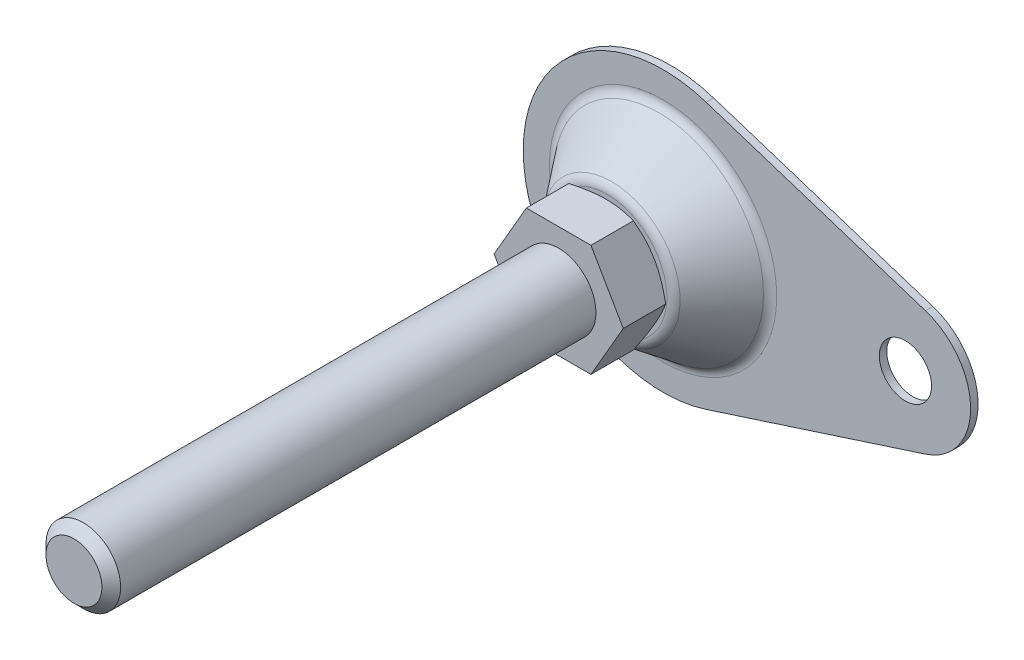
ISO-10303-21;
HEADER;
FILE_DESCRIPTION(('STEP AP214'),'2;1');
FILE_NAME('part.step','',(''),(''),'','','');
FILE_SCHEMA(('AUTOMOTIVE_DESIGN { 1 0 10303 214 1 1 1 1 }'));
ENDSEC;
DATA;
#1=APPLICATION_CONTEXT('core data for automotive mechanical design processes');
#2=APPLICATION_PROTOCOL_DEFINITION('international standard','automotive_design',2000,#1);
#3=PRODUCT_CONTEXT('',#1,'mechanical');
#4=PRODUCT('Part','Part','',(#3));
#5=PRODUCT_RELATED_PRODUCT_CATEGORY('part','',(#4));
#6=PRODUCT_DEFINITION_FORMATION('','',#4);
#7=PRODUCT_DEFINITION_CONTEXT('part definition',#1,'design');
#8=PRODUCT_DEFINITION('design','',#6,#7);
#9=PRODUCT_DEFINITION_SHAPE('','',#8);
#10=(LENGTH_UNIT() NAMED_UNIT(*) SI_UNIT(.MILLI.,.METRE.));
#11=(NAMED_UNIT(*) PLANE_ANGLE_UNIT() SI_UNIT($,.RADIAN.));
#12=(NAMED_UNIT(*) SI_UNIT($,.STERADIAN.) SOLID_ANGLE_UNIT());
#13=UNCERTAINTY_MEASURE_WITH_UNIT(LENGTH_MEASURE(1.E-05),#10,'distance_accuracy_value','');
#14=(GEOMETRIC_REPRESENTATION_CONTEXT(3) GLOBAL_UNCERTAINTY_ASSIGNED_CONTEXT((#13)) GLOBAL_UNIT_ASSIGNED_CONTEXT((#10,
#11,#12)) REPRESENTATION_CONTEXT('',''));
#15=CARTESIAN_POINT('',(0.,0.,0.));
#16=DIRECTION('',(0.,0.,1.));
#17=DIRECTION('',(1.,0.,0.));
#18=AXIS2_PLACEMENT_3D('',#15,#16,#17);
#19=CARTESIAN_POINT('',(65.,0.,2.));
#20=DIRECTION('',(0.,0.,1.));
#21=DIRECTION('',(1.,0.,0.));
#22=AXIS2_PLACEMENT_3D('',#19,#20,#21);
#23=PLANE('',#22);
#24=CARTESIAN_POINT('',(0.,0.,2.));
#25=DIRECTION('',(0.,0.,1.));
#26=DIRECTION('',(1.,0.,0.));
#27=AXIS2_PLACEMENT_3D('',#24,#25,#26);
#28=CIRCLE('',#27,30.4802116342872);
#29=CARTESIAN_POINT('',(30.4802116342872,0.,2.));
#30=VERTEX_POINT('',#29);
#31=EDGE_CURVE('E245',#30,#30,#28,.F.);
#32=ORIENTED_EDGE('',*,*,#31,.T.);
#33=EDGE_LOOP('',(#32));
#34=FACE_BOUND('',#33,.T.);
#35=CARTESIAN_POINT('',(65.,0.,2.));
#36=DIRECTION('',(0.,0.,1.));
#37=DIRECTION('',(1.,0.,0.));
#38=AXIS2_PLACEMENT_3D('',#35,#36,#37);
#39=CIRCLE('',#38,7.);
#40=CARTESIAN_POINT('',(72.,0.,2.));
#41=VERTEX_POINT('',#40);
#42=EDGE_CURVE('E262',#41,#41,#39,.T.);
#43=ORIENTED_EDGE('',*,*,#42,.F.);
#44=EDGE_LOOP('',(#43));
#45=FACE_BOUND('',#44,.T.);
#46=DIRECTION('',(-0.951485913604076,0.307692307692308,0.));
#47=VECTOR('',#46,1.);
#48=CARTESIAN_POINT('',(11.5384615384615,35.6807217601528,2.));
#49=LINE('',#48,#47);
#50=CARTESIAN_POINT('',(70.3846153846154,16.6510034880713,2.));
#51=VERTEX_POINT('',#50);
#52=CARTESIAN_POINT('',(11.5384615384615,35.6807217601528,2.));
#53=VERTEX_POINT('',#52);
#54=EDGE_CURVE('E112',#51,#53,#49,.T.);
#55=ORIENTED_EDGE('',*,*,#54,.T.);
#56=CARTESIAN_POINT('',(0.,0.,2.));
#57=DIRECTION('',(0.,0.,1.));
#58=DIRECTION('',(1.,0.,0.));
#59=AXIS2_PLACEMENT_3D('',#56,#57,#58);
#60=CIRCLE('',#59,37.5);
#61=CARTESIAN_POINT('',(11.5384615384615,-35.6807217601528,2.));
#62=VERTEX_POINT('',#61);
#63=EDGE_CURVE('E114',#53,#62,#60,.T.);
#64=ORIENTED_EDGE('',*,*,#63,.T.);
#65=DIRECTION('',(0.951485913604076,0.307692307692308,0.));
#66=VECTOR('',#65,1.);
#67=CARTESIAN_POINT('',(11.5384615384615,-35.6807217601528,2.));
#68=LINE('',#67,#66);
#69=CARTESIAN_POINT('',(70.3846153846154,-16.6510034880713,2.));
#70=VERTEX_POINT('',#69);
#71=EDGE_CURVE('E97',#62,#70,#68,.T.);
#72=ORIENTED_EDGE('',*,*,#71,.T.);
#73=CARTESIAN_POINT('',(65.,0.,2.));
#74=DIRECTION('',(0.,0.,1.));
#75=DIRECTION('',(1.,0.,0.));
#76=AXIS2_PLACEMENT_3D('',#73,#74,#75);
#77=CIRCLE('',#76,17.5);
#78=EDGE_CURVE('E106',#70,#51,#77,.T.);
#79=ORIENTED_EDGE('',*,*,#78,.T.);
#80=EDGE_LOOP('',(#55,#64,#72,#79));
#81=FACE_BOUND('',#80,.T.);
#82=ADVANCED_FACE('F14',(#34,#45,#81),#23,.T.);
#83=CARTESIAN_POINT('',(65.,0.,0.));
#84=DIRECTION('',(0.,0.,1.));
#85=DIRECTION('',(1.,0.,0.));
#86=AXIS2_PLACEMENT_3D('',#83,#84,#85);
#87=PLANE('',#86);
#88=CARTESIAN_POINT('',(65.,0.,0.));
#89=DIRECTION('',(0.,0.,1.));
#90=DIRECTION('',(1.,0.,0.));
#91=AXIS2_PLACEMENT_3D('',#88,#89,#90);
#92=CIRCLE('',#91,7.);
#93=CARTESIAN_POINT('',(72.,0.,0.));
#94=VERTEX_POINT('',#93);
#95=EDGE_CURVE('E258',#94,#94,#92,.T.);
#96=ORIENTED_EDGE('',*,*,#95,.T.);
#97=EDGE_LOOP('',(#96));
#98=FACE_BOUND('',#97,.T.);
#99=CARTESIAN_POINT('',(0.,0.,0.));
#100=DIRECTION('',(0.,0.,1.));
#101=DIRECTION('',(1.,0.,0.));
#102=AXIS2_PLACEMENT_3D('',#99,#100,#101);
#103=CIRCLE('',#102,37.5);
#104=CARTESIAN_POINT('',(11.5384615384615,35.6807217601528,0.));
#105=VERTEX_POINT('',#104);
#106=CARTESIAN_POINT('',(11.5384615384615,-35.6807217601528,0.));
#107=VERTEX_POINT('',#106);
#108=EDGE_CURVE('E275',#105,#107,#103,.T.);
#109=ORIENTED_EDGE('',*,*,#108,.F.);
#110=DIRECTION('',(-0.951485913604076,0.307692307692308,0.));
#111=VECTOR('',#110,1.);
#112=CARTESIAN_POINT('',(70.3846153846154,16.6510034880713,0.));
#113=LINE('',#112,#111);
#114=CARTESIAN_POINT('',(70.3846153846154,16.6510034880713,0.));
#115=VERTEX_POINT('',#114);
#116=EDGE_CURVE('E9',#115,#105,#113,.T.);
#117=ORIENTED_EDGE('',*,*,#116,.F.);
#118=CARTESIAN_POINT('',(65.,0.,0.));
#119=DIRECTION('',(0.,0.,1.));
#120=DIRECTION('',(1.,0.,0.));
#121=AXIS2_PLACEMENT_3D('',#118,#119,#120);
#122=CIRCLE('',#121,17.5);
#123=CARTESIAN_POINT('',(70.3846153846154,-16.6510034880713,0.));
#124=VERTEX_POINT('',#123);
#125=EDGE_CURVE('E22',#124,#115,#122,.T.);
#126=ORIENTED_EDGE('',*,*,#125,.F.);
#127=DIRECTION('',(0.951485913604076,0.307692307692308,0.));
#128=VECTOR('',#127,1.);
#129=CARTESIAN_POINT('',(70.3846153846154,-16.6510034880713,0.));
#130=LINE('',#129,#128);
#131=EDGE_CURVE('E99',#107,#124,#130,.T.);
#132=ORIENTED_EDGE('',*,*,#131,.F.);
#133=EDGE_LOOP('',(#109,#117,#126,#132));
#134=FACE_BOUND('',#133,.T.);
#135=ADVANCED_FACE('F215',(#98,#134),#87,.F.);
#136=CARTESIAN_POINT('',(0.,0.,17.));
#137=DIRECTION('',(0.,0.,-1.));
#138=DIRECTION('',(-1.,0.,0.));
#139=AXIS2_PLACEMENT_3D('',#136,#137,#138);
#140=PLANE('',#139);
#141=CARTESIAN_POINT('',(0.,0.,17.));
#142=DIRECTION('',(0.,0.,-1.));
#143=DIRECTION('',(-1.,0.,0.));
#144=AXIS2_PLACEMENT_3D('',#141,#142,#143);
#145=CIRCLE('',#144,16.0197883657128);
#146=CARTESIAN_POINT('',(-16.0197883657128,0.,17.));
#147=VERTEX_POINT('',#146);
#148=EDGE_CURVE('E278',#147,#147,#145,.F.);
#149=ORIENTED_EDGE('',*,*,#148,.T.);
#150=EDGE_LOOP('',(#149));
#151=FACE_BOUND('',#150,.T.);
#152=CARTESIAN_POINT('',(0.,0.,17.));
#153=DIRECTION('',(0.,0.,-1.));
#154=DIRECTION('',(-1.,0.,0.));
#155=AXIS2_PLACEMENT_3D('',#152,#153,#154);
#156=CIRCLE('',#155,14.5);
#157=CARTESIAN_POINT('',(-14.5,0.,17.));
#158=VERTEX_POINT('',#157);
#159=EDGE_CURVE('E122',#158,#158,#156,.T.);
#160=ORIENTED_EDGE('',*,*,#159,.T.);
#161=EDGE_LOOP('',(#160));
#162=FACE_BOUND('',#161,.T.);
#163=ADVANCED_FACE('F211',(#151,#162),#140,.F.);
#164=CARTESIAN_POINT('',(0.,0.,5.));
#165=DIRECTION('',(0.,0.,1.));
#166=DIRECTION('',(1.,0.,0.));
#167=AXIS2_PLACEMENT_3D('',#164,#165,#166);
#168=TOROIDAL_SURFACE('',#167,30.4802116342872,3.);
#169=CARTESIAN_POINT('',(0.,0.,3.1747053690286));
#170=DIRECTION('',(0.,0.,1.));
#171=DIRECTION('',(1.,0.,0.));
#172=AXIS2_PLACEMENT_3D('',#169,#170,#171);
#173=CIRCLE('',#172,28.0993925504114);
#174=CARTESIAN_POINT('',(28.0993925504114,0.,3.1747053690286));
#175=VERTEX_POINT('',#174);
#176=EDGE_CURVE('E242',#175,#175,#173,.T.);
#177=ORIENTED_EDGE('',*,*,#176,.F.);
#178=EDGE_LOOP('',(#177));
#179=FACE_BOUND('',#178,.T.);
#180=ORIENTED_EDGE('',*,*,#31,.F.);
#181=EDGE_LOOP('',(#180));
#182=FACE_BOUND('',#181,.T.);
#183=ADVANCED_FACE('F214',(#179,#182),#168,.F.);
#184=CARTESIAN_POINT('',(0.,0.,14.));
#185=DIRECTION('',(0.,0.,-1.));
#186=DIRECTION('',(-1.,0.,0.));
#187=AXIS2_PLACEMENT_3D('',#184,#185,#186);
#188=TOROIDAL_SURFACE('',#187,16.0197883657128,3.);
#189=ORIENTED_EDGE('',*,*,#148,.F.);
#190=EDGE_LOOP('',(#189));
#191=FACE_BOUND('',#190,.T.);
#192=CARTESIAN_POINT('',(0.,0.,15.8252946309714));
#193=DIRECTION('',(0.,0.,1.));
#194=DIRECTION('',(1.,0.,0.));
#195=AXIS2_PLACEMENT_3D('',#192,#193,#194);
#196=CIRCLE('',#195,18.4006074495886);
#197=CARTESIAN_POINT('',(18.4006074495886,0.,15.8252946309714));
#198=VERTEX_POINT('',#197);
#199=EDGE_CURVE('E251',#198,#198,#196,.F.);
#200=ORIENTED_EDGE('',*,*,#199,.F.);
#201=EDGE_LOOP('',(#200));
#202=FACE_BOUND('',#201,.T.);
#203=ADVANCED_FACE('F229',(#191,#202),#188,.T.);
#204=CARTESIAN_POINT('',(0.,0.,2.));
#205=DIRECTION('',(0.,0.,-1.));
#206=DIRECTION('',(-1.,0.,0.));
#207=AXIS2_PLACEMENT_3D('',#204,#205,#206);
#208=CYLINDRICAL_SURFACE('',#207,37.5);
#209=ORIENTED_EDGE('',*,*,#108,.T.);
#210=DIRECTION('',(0.,0.,1.));
#211=VECTOR('',#210,1.);
#212=CARTESIAN_POINT('',(11.5384615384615,-35.6807217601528,-8.));
#213=LINE('',#212,#211);
#214=EDGE_CURVE('E103',#107,#62,#213,.T.);
#215=ORIENTED_EDGE('',*,*,#214,.T.);
#216=ORIENTED_EDGE('',*,*,#63,.F.);
#217=DIRECTION('',(0.,0.,1.));
#218=VECTOR('',#217,1.);
#219=CARTESIAN_POINT('',(11.5384615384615,35.6807217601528,-8.));
#220=LINE('',#219,#218);
#221=EDGE_CURVE('E119',#105,#53,#220,.T.);
#222=ORIENTED_EDGE('',*,*,#221,.F.);
#223=EDGE_LOOP('',(#209,#215,#216,#222));
#224=FACE_BOUND('',#223,.T.);
#225=ADVANCED_FACE('F219',(#224),#208,.T.);
#226=CARTESIAN_POINT('',(65.,0.,2.));
#227=DIRECTION('',(0.,0.,-1.));
#228=DIRECTION('',(-1.,0.,0.));
#229=AXIS2_PLACEMENT_3D('',#226,#227,#228);
#230=CYLINDRICAL_SURFACE('',#229,7.);
#231=ORIENTED_EDGE('',*,*,#42,.T.);
#232=EDGE_LOOP('',(#231));
#233=FACE_BOUND('',#232,.T.);
#234=ORIENTED_EDGE('',*,*,#95,.F.);
#235=EDGE_LOOP('',(#234));
#236=FACE_BOUND('',#235,.T.);
#237=ADVANCED_FACE('F209',(#233,#236),#230,.F.);
#238=CARTESIAN_POINT('',(0.,0.,2.));
#239=DIRECTION('',(0.,0.,-1.));
#240=DIRECTION('',(-1.,0.,0.));
#241=AXIS2_PLACEMENT_3D('',#238,#239,#240);
#242=CONICAL_SURFACE('',#241,29.,0.654082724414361);
#243=ORIENTED_EDGE('',*,*,#176,.T.);
#244=EDGE_LOOP('',(#243));
#245=FACE_BOUND('',#244,.T.);
#246=ORIENTED_EDGE('',*,*,#199,.T.);
#247=EDGE_LOOP('',(#246));
#248=FACE_BOUND('',#247,.T.);
#249=ADVANCED_FACE('F151',(#245,#248),#242,.T.);
#250=CARTESIAN_POINT('',(0.,0.,17.));
#251=DIRECTION('',(0.,0.,1.));
#252=DIRECTION('',(1.,0.,0.));
#253=AXIS2_PLACEMENT_3D('',#250,#251,#252);
#254=CONICAL_SURFACE('',#253,14.5,1.0471975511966);
#255=ORIENTED_EDGE('',*,*,#159,.F.);
#256=EDGE_LOOP('',(#255));
#257=FACE_BOUND('',#256,.T.);
#258=CARTESIAN_POINT('',(17.3206235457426,0.0002,18.6284877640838));
#259=CARTESIAN_POINT('',(17.130274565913,-0.329494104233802,18.5185969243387));
#260=CARTESIAN_POINT('',(16.939183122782,-0.660474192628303,18.4136927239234));
#261=CARTESIAN_POINT('',(16.5554679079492,-1.32508844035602,18.2152437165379));
#262=CARTESIAN_POINT('',(16.3628436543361,-1.6587234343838,18.1217026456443));
#263=CARTESIAN_POINT('',(15.9756905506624,-2.32929228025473,17.9472372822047));
#264=CARTESIAN_POINT('',(15.7811583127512,-2.66623200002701,17.866342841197));
#265=CARTESIAN_POINT('',(15.3907420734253,-3.34245276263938,17.7189077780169));
#266=CARTESIAN_POINT('',(15.1948581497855,-3.68173367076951,17.6523663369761));
#267=CARTESIAN_POINT('',(14.8067578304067,-4.35394314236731,17.5364675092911));
#268=CARTESIAN_POINT('',(14.6145702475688,-4.68682180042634,17.4867265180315));
#269=CARTESIAN_POINT('',(14.2293144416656,-5.35410443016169,17.4033218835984));
#270=CARTESIAN_POINT('',(14.0362462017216,-5.68850843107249,17.3696585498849));
#271=CARTESIAN_POINT('',(13.6497853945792,-6.35787818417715,17.3192592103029));
#272=CARTESIAN_POINT('',(13.4563934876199,-6.69284279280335,17.3025030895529));
#273=CARTESIAN_POINT('',(13.0694311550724,-7.363081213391,17.2862785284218));
#274=CARTESIAN_POINT('',(12.8758607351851,-7.69835501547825,17.2868095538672));
#275=CARTESIAN_POINT('',(12.5139822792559,-8.3251468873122,17.303951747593));
#276=CARTESIAN_POINT('',(12.3456484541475,-8.61670962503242,17.3184719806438));
#277=CARTESIAN_POINT('',(12.0093680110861,-9.19916443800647,17.3603122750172));
#278=CARTESIAN_POINT('',(11.8414214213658,-9.49005646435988,17.3876332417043));
#279=CARTESIAN_POINT('',(11.5060066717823,-10.0710118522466,17.4545986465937));
#280=CARTESIAN_POINT('',(11.338539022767,-10.3610743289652,17.4942532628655));
#281=CARTESIAN_POINT('',(11.0043888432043,-10.939839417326,17.5851902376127));
#282=CARTESIAN_POINT('',(10.8377063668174,-11.2285419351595,17.6364733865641));
#283=CARTESIAN_POINT('',(10.3317324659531,-12.1049144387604,17.8090619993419));
#284=CARTESIAN_POINT('',(9.99390625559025,-12.6900465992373,17.9475763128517));
#285=CARTESIAN_POINT('',(9.32329122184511,-13.8515859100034,18.26194710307));
#286=CARTESIAN_POINT('',(8.99049381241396,-14.4280079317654,18.4377297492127));
#287=CARTESIAN_POINT('',(8.66013856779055,-15.0002,18.6284877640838));
#288=B_SPLINE_CURVE_WITH_KNOTS('',3,(#258,#259,#260,#261,#262,#263,#264,#265,#266,#267,#268,
#269,#270,#271,#272,#273,#274,#275,#276,#277,#278,#279,#280,#281,#282,#283,#284,#285,#286,#287),
.UNSPECIFIED.,.F.,.F.,(4,2,2,2,2,2,2,2,2,2,2,2,2,2,4),(0.,1.18875411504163,2.37789802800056,
3.56980778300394,4.76164951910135,5.92407379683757,7.0865204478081,8.24758247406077,
9.40860862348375,10.4193068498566,11.4300765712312,12.4416826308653,13.4533574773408,
15.5211962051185,17.5849760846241),.UNSPECIFIED.);
#289=CARTESIAN_POINT('',(17.3205080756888,0.,18.6284210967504));
#290=VERTEX_POINT('',#289);
#291=CARTESIAN_POINT('',(8.66025403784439,-15.,18.6284210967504));
#292=VERTEX_POINT('',#291);
#293=EDGE_CURVE('E29',#290,#292,#288,.T.);
#294=ORIENTED_EDGE('',*,*,#293,.T.);
#295=CARTESIAN_POINT('',(-23.2059535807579,-15.,24.5816473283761));
#296=CARTESIAN_POINT('',(-22.878571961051,-15.,24.4229113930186));
#297=CARTESIAN_POINT('',(-22.5508045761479,-15.,24.2649714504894));
#298=CARTESIAN_POINT('',(-21.8944177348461,-15.,23.9508639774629));
#299=CARTESIAN_POINT('',(-21.5657982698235,-15.,23.7946964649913));
#300=CARTESIAN_POINT('',(-20.5784525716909,-15.,23.3290816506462));
#301=CARTESIAN_POINT('',(-19.9183368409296,-15.,23.0225696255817));
#302=CARTESIAN_POINT('',(-18.5900494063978,-15.,22.4175761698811));
#303=CARTESIAN_POINT('',(-17.9218533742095,-15.,22.119148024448));
#304=CARTESIAN_POINT('',(-16.5801262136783,-15.,21.5345790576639));
#305=CARTESIAN_POINT('',(-15.9065953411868,-15.,21.2484376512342));
#306=CARTESIAN_POINT('',(-14.5318361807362,-15.,20.682938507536));
#307=CARTESIAN_POINT('',(-13.8304027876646,-15.,20.4040767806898));
#308=CARTESIAN_POINT('',(-12.4193045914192,-15.,19.8675949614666));
#309=CARTESIAN_POINT('',(-11.7096388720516,-15.,19.6099772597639));
#310=CARTESIAN_POINT('',(-10.282315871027,-15.,19.1227899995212));
#311=CARTESIAN_POINT('',(-9.5646782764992,-15.,18.8931632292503));
#312=CARTESIAN_POINT('',(-8.11904257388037,-15.,18.4693496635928));
#313=CARTESIAN_POINT('',(-7.39104782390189,-15.,18.2751516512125));
#314=CARTESIAN_POINT('',(-6.29311467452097,-15.,18.0179947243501));
#315=CARTESIAN_POINT('',(-5.92711142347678,-15.,17.938130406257));
#316=CARTESIAN_POINT('',(-5.19261469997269,-15.,17.790747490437));
#317=CARTESIAN_POINT('',(-4.82412127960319,-15.,17.7232286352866));
#318=CARTESIAN_POINT('',(-4.08490254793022,-15.,17.6017319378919));
#319=CARTESIAN_POINT('',(-3.71417726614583,-15.,17.5477539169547));
#320=CARTESIAN_POINT('',(-2.97089386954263,-15.,17.4544179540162));
#321=CARTESIAN_POINT('',(-2.59833583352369,-15.,17.4150593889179));
#322=CARTESIAN_POINT('',(-1.8567481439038,-15.,17.3522344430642));
#323=CARTESIAN_POINT('',(-1.48773552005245,-15.,17.3285682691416));
#324=CARTESIAN_POINT('',(-0.749041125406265,-15.,17.296858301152));
#325=CARTESIAN_POINT('',(-0.379359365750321,-15.,17.2888142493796));
#326=CARTESIAN_POINT('',(0.36001777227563,-15.,17.2885396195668));
#327=CARTESIAN_POINT('',(0.729713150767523,-15.,17.2963092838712));
#328=CARTESIAN_POINT('',(1.46844854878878,-15.,17.3274738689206));
#329=CARTESIAN_POINT('',(1.83748853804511,-15.,17.3508694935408));
#330=CARTESIAN_POINT('',(2.72593127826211,-15.,17.4255090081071));
#331=CARTESIAN_POINT('',(3.24471502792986,-15.,17.4842509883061));
#332=CARTESIAN_POINT('',(4.27839972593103,-15.,17.6294036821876));
#333=CARTESIAN_POINT('',(4.79330013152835,-15.,17.7158181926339));
#334=CARTESIAN_POINT('',(5.81873065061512,-15.,17.9132421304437));
#335=CARTESIAN_POINT('',(6.32925708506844,-15.,18.0242704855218));
#336=CARTESIAN_POINT('',(7.34517442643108,-15.,18.2675402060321));
#337=CARTESIAN_POINT('',(7.85056541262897,-15.,18.399781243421));
#338=CARTESIAN_POINT('',(8.86768339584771,-15.,18.6854895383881));
#339=CARTESIAN_POINT('',(9.37929323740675,-15.,18.8393710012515));
#340=CARTESIAN_POINT('',(10.3974702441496,-15.,19.162915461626));
#341=CARTESIAN_POINT('',(10.9040373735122,-15.,19.3325785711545));
#342=CARTESIAN_POINT('',(11.9123863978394,-15.,19.6850019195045));
#343=CARTESIAN_POINT('',(12.4141698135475,-15.,19.8677578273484));
#344=CARTESIAN_POINT('',(13.4135811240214,-15.,20.244227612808));
#345=CARTESIAN_POINT('',(13.9112090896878,-15.,20.4379413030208));
#346=CARTESIAN_POINT('',(15.1747683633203,-15.,20.9432670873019));
#347=CARTESIAN_POINT('',(15.9381435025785,-15.,21.2612645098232));
#348=CARTESIAN_POINT('',(17.4577496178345,-15.,21.9139474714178));
#349=CARTESIAN_POINT('',(18.2139799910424,-15.,22.2486344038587));
#350=CARTESIAN_POINT('',(19.7208047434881,-15.,22.9310054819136));
#351=CARTESIAN_POINT('',(20.4713973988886,-15.,23.2786934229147));
#352=CARTESIAN_POINT('',(21.9677798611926,-15.,23.9841690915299));
#353=CARTESIAN_POINT('',(22.7135698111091,-15.,24.3419565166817));
#354=CARTESIAN_POINT('',(24.2022173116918,-15.,25.0660447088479));
#355=CARTESIAN_POINT('',(24.945069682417,-15.,25.4323561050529));
#356=CARTESIAN_POINT('',(26.4275407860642,-15.,26.1714660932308));
#357=CARTESIAN_POINT('',(27.1671594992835,-15.,26.5442647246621));
#358=CARTESIAN_POINT('',(28.6435840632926,-15.,27.2950828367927));
#359=CARTESIAN_POINT('',(29.3803903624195,-15.,27.6731014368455));
#360=CARTESIAN_POINT('',(30.8517467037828,-15.,28.4334955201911));
#361=CARTESIAN_POINT('',(31.5862967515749,-15.,28.8158709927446));
#362=CARTESIAN_POINT('',(33.6472469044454,-15.,29.8951695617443));
#363=CARTESIAN_POINT('',(34.971496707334,-15.,30.5961982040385));
#364=CARTESIAN_POINT('',(37.6154278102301,-15.,32.0069470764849));
#365=CARTESIAN_POINT('',(38.9351088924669,-15.,32.7166677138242));
#366=CARTESIAN_POINT('',(41.5671653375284,-15.,34.1406319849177));
#367=CARTESIAN_POINT('',(42.8795508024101,-15.,34.8548569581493));
#368=CARTESIAN_POINT('',(44.8460166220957,-15.,35.9299538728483));
#369=CARTESIAN_POINT('',(45.5011323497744,-15.,36.2889346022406));
#370=CARTESIAN_POINT('',(46.8107453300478,-15.,37.0080204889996));
#371=CARTESIAN_POINT('',(47.4652425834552,-15.,37.3681256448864));
#372=CARTESIAN_POINT('',(48.119467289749,-15.,37.7287254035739));
#373=B_SPLINE_CURVE_WITH_KNOTS('',3,(#295,#296,#297,#298,#299,#300,#301,#302,#303,#304,#305,
#306,#307,#308,#309,#310,#311,#312,#313,#314,#315,#316,#317,#318,#319,#320,#321,#322,#323,#324,
#325,#326,#327,#328,#329,#330,#331,#332,#333,#334,#335,#336,#337,#338,#339,#340,#341,#342,#343,
#344,#345,#346,#347,#348,#349,#350,#351,#352,#353,#354,#355,#356,#357,#358,#359,#360,#361,#362,
#363,#364,#365,#366,#367,#368,#369,#370,#371,#372),.UNSPECIFIED.,.F.,.F.,(4,2,2,2,2,2,2,2,2,2,2,
2,2,2,2,2,2,2,2,2,2,2,2,2,2,2,2,2,2,2,2,2,2,2,2,2,2,2,4),(0.,1.0915026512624,2.183016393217,
4.36637011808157,6.56170258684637,8.75693040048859,11.0211663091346,13.2856566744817,
15.5454380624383,17.8045027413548,18.9281743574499,20.0518225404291,21.1754558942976,
22.2990413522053,23.4080318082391,24.5170039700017,25.6259931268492,26.7350322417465,
28.3004619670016,29.8661065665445,31.4329593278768,32.9997878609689,34.6022361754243,
36.2046958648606,37.8066279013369,39.408532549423,41.8891283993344,44.3699316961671,
46.8514649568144,49.3329239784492,51.8176634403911,54.3024180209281,56.7867584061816,
59.2710926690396,63.7661188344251,68.2613563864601,72.7437797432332,74.9848487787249,
77.2259148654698),.UNSPECIFIED.);
#374=CARTESIAN_POINT('',(-8.6602540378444,-15.,18.6284210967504));
#375=VERTEX_POINT('',#374);
#376=EDGE_CURVE('E158',#292,#375,#373,.F.);
#377=ORIENTED_EDGE('',*,*,#376,.T.);
#378=CARTESIAN_POINT('',(-8.66013856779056,-15.0002,18.6284877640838));
#379=CARTESIAN_POINT('',(-8.85048754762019,-14.6705058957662,18.5185969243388));
#380=CARTESIAN_POINT('',(-9.04157899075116,-14.3395258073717,18.4136927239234));
#381=CARTESIAN_POINT('',(-9.42529420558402,-13.674911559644,18.2152437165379));
#382=CARTESIAN_POINT('',(-9.61791845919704,-13.3412765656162,18.1217026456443));
#383=CARTESIAN_POINT('',(-10.0050715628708,-12.6707077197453,17.9472372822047));
#384=CARTESIAN_POINT('',(-10.199603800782,-12.333767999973,17.866342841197));
#385=CARTESIAN_POINT('',(-10.5900200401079,-11.6575472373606,17.7189077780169));
#386=CARTESIAN_POINT('',(-10.7859039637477,-11.3182663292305,17.6523663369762));
#387=CARTESIAN_POINT('',(-11.1740042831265,-10.6460568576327,17.5364675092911));
#388=CARTESIAN_POINT('',(-11.3661918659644,-10.3131781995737,17.4867265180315));
#389=CARTESIAN_POINT('',(-11.7514476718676,-9.64589556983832,17.4033218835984));
#390=CARTESIAN_POINT('',(-11.9445159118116,-9.31149156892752,17.3696585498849));
#391=CARTESIAN_POINT('',(-12.3309767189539,-8.64212181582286,17.3192592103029));
#392=CARTESIAN_POINT('',(-12.5243686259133,-8.30715720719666,17.3025030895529));
#393=CARTESIAN_POINT('',(-12.9113309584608,-7.63691878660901,17.2862785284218));
#394=CARTESIAN_POINT('',(-13.1049013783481,-7.30164498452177,17.2868095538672));
#395=CARTESIAN_POINT('',(-13.4667798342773,-6.67485311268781,17.303951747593));
#396=CARTESIAN_POINT('',(-13.6351136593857,-6.38329037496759,17.3184719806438));
#397=CARTESIAN_POINT('',(-13.9713941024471,-5.80083556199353,17.3603122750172));
#398=CARTESIAN_POINT('',(-14.1393406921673,-5.50994353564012,17.3876332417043));
#399=CARTESIAN_POINT('',(-14.4747554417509,-4.92898814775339,17.4545986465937));
#400=CARTESIAN_POINT('',(-14.6422230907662,-4.63892567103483,17.4942532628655));
#401=CARTESIAN_POINT('',(-14.9763732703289,-4.06016058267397,17.5851902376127));
#402=CARTESIAN_POINT('',(-15.1430557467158,-3.77145806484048,17.6364733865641));
#403=CARTESIAN_POINT('',(-15.6490296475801,-2.8950855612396,17.8090619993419));
#404=CARTESIAN_POINT('',(-15.9868558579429,-2.30995340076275,17.9475763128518));
#405=CARTESIAN_POINT('',(-16.6574708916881,-1.14841408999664,18.26194710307));
#406=CARTESIAN_POINT('',(-16.9902683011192,-0.571992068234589,18.4377297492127));
#407=CARTESIAN_POINT('',(-17.3206235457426,0.000199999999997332,18.6284877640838));
#408=B_SPLINE_CURVE_WITH_KNOTS('',3,(#378,#379,#380,#381,#382,#383,#384,#385,#386,#387,#388,
#389,#390,#391,#392,#393,#394,#395,#396,#397,#398,#399,#400,#401,#402,#403,#404,#405,#406,#407),
.UNSPECIFIED.,.F.,.F.,(4,2,2,2,2,2,2,2,2,2,2,2,2,2,4),(0.,1.18875411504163,2.37789802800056,
3.56980778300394,4.76164951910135,5.92407379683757,7.0865204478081,8.24758247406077,
9.40860862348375,10.4193068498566,11.4300765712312,12.4416826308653,13.4533574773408,
15.5211962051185,17.5849760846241),.UNSPECIFIED.);
#409=CARTESIAN_POINT('',(-17.3205080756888,0.,18.6284210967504));
#410=VERTEX_POINT('',#409);
#411=EDGE_CURVE('E127',#375,#410,#408,.T.);
#412=ORIENTED_EDGE('',*,*,#411,.T.);
#413=CARTESIAN_POINT('',(-17.3206235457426,-0.0002,18.6284877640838));
#414=CARTESIAN_POINT('',(-17.130274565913,0.329494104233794,18.5185969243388));
#415=CARTESIAN_POINT('',(-16.939183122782,0.660474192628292,18.4136927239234));
#416=CARTESIAN_POINT('',(-16.5554679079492,1.32508844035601,18.2152437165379));
#417=CARTESIAN_POINT('',(-16.3628436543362,1.65872343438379,18.1217026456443));
#418=CARTESIAN_POINT('',(-15.9756905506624,2.32929228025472,17.9472372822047));
#419=CARTESIAN_POINT('',(-15.7811583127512,2.66623200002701,17.866342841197));
#420=CARTESIAN_POINT('',(-15.3907420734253,3.34245276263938,17.7189077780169));
#421=CARTESIAN_POINT('',(-15.1948581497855,3.68173367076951,17.6523663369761));
#422=CARTESIAN_POINT('',(-14.8067578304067,4.35394314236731,17.5364675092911));
#423=CARTESIAN_POINT('',(-14.6145702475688,4.68682180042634,17.4867265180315));
#424=CARTESIAN_POINT('',(-14.2293144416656,5.3541044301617,17.4033218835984));
#425=CARTESIAN_POINT('',(-14.0362462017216,5.68850843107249,17.3696585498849));
#426=CARTESIAN_POINT('',(-13.6497853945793,6.35787818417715,17.3192592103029));
#427=CARTESIAN_POINT('',(-13.4563934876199,6.69284279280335,17.3025030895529));
#428=CARTESIAN_POINT('',(-13.0694311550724,7.36308121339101,17.2862785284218));
#429=CARTESIAN_POINT('',(-12.8758607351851,7.69835501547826,17.2868095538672));
#430=CARTESIAN_POINT('',(-12.5139822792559,8.32514688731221,17.303951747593));
#431=CARTESIAN_POINT('',(-12.3456484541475,8.61670962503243,17.3184719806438));
#432=CARTESIAN_POINT('',(-12.0093680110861,9.19916443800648,17.3603122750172));
#433=CARTESIAN_POINT('',(-11.8414214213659,9.49005646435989,17.3876332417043));
#434=CARTESIAN_POINT('',(-11.5060066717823,10.0710118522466,17.4545986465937));
#435=CARTESIAN_POINT('',(-11.338539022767,10.3610743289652,17.4942532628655));
#436=CARTESIAN_POINT('',(-11.0043888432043,10.939839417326,17.5851902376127));
#437=CARTESIAN_POINT('',(-10.8377063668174,11.2285419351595,17.6364733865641));
#438=CARTESIAN_POINT('',(-10.3317324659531,12.1049144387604,17.8090619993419));
#439=CARTESIAN_POINT('',(-9.99390625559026,12.6900465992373,17.9475763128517));
#440=CARTESIAN_POINT('',(-9.32329122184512,13.8515859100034,18.26194710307));
#441=CARTESIAN_POINT('',(-8.99049381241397,14.4280079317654,18.4377297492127));
#442=CARTESIAN_POINT('',(-8.66013856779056,15.0002,18.6284877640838));
#443=B_SPLINE_CURVE_WITH_KNOTS('',3,(#413,#414,#415,#416,#417,#418,#419,#420,#421,#422,#423,
#424,#425,#426,#427,#428,#429,#430,#431,#432,#433,#434,#435,#436,#437,#438,#439,#440,#441,#442),
.UNSPECIFIED.,.F.,.F.,(4,2,2,2,2,2,2,2,2,2,2,2,2,2,4),(0.,1.18875411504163,2.37789802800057,
3.56980778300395,4.76164951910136,5.92407379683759,7.08652044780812,8.24758247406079,
9.40860862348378,10.4193068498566,11.4300765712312,12.4416826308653,13.4533574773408,
15.5211962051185,17.5849760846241),.UNSPECIFIED.);
#444=CARTESIAN_POINT('',(-8.6602540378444,15.,18.6284210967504));
#445=VERTEX_POINT('',#444);
#446=EDGE_CURVE('E135',#410,#445,#443,.T.);
#447=ORIENTED_EDGE('',*,*,#446,.T.);
#448=CARTESIAN_POINT('',(-23.2059535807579,15.,24.5816473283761));
#449=CARTESIAN_POINT('',(-22.878571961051,15.,24.4229113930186));
#450=CARTESIAN_POINT('',(-22.5508045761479,15.,24.2649714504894));
#451=CARTESIAN_POINT('',(-21.8944177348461,15.,23.9508639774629));
#452=CARTESIAN_POINT('',(-21.5657982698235,15.,23.7946964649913));
#453=CARTESIAN_POINT('',(-20.5784525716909,15.,23.3290816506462));
#454=CARTESIAN_POINT('',(-19.9183368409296,15.,23.0225696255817));
#455=CARTESIAN_POINT('',(-18.5900494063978,15.,22.4175761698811));
#456=CARTESIAN_POINT('',(-17.9218533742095,15.,22.119148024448));
#457=CARTESIAN_POINT('',(-16.5801262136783,15.,21.5345790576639));
#458=CARTESIAN_POINT('',(-15.9065953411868,15.,21.2484376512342));
#459=CARTESIAN_POINT('',(-14.5318361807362,15.,20.682938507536));
#460=CARTESIAN_POINT('',(-13.8304027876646,15.,20.4040767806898));
#461=CARTESIAN_POINT('',(-12.4193045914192,15.,19.8675949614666));
#462=CARTESIAN_POINT('',(-11.7096388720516,15.,19.6099772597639));
#463=CARTESIAN_POINT('',(-10.282315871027,15.,19.1227899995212));
#464=CARTESIAN_POINT('',(-9.5646782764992,15.,18.8931632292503));
#465=CARTESIAN_POINT('',(-8.11904257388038,15.,18.4693496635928));
#466=CARTESIAN_POINT('',(-7.39104782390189,15.,18.2751516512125));
#467=CARTESIAN_POINT('',(-6.29311467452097,15.,18.0179947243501));
#468=CARTESIAN_POINT('',(-5.92711142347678,15.,17.938130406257));
#469=CARTESIAN_POINT('',(-5.19261469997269,15.,17.790747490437));
#470=CARTESIAN_POINT('',(-4.82412127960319,15.,17.7232286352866));
#471=CARTESIAN_POINT('',(-4.08490254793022,15.,17.6017319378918));
#472=CARTESIAN_POINT('',(-3.71417726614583,15.,17.5477539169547));
#473=CARTESIAN_POINT('',(-2.97089386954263,15.,17.4544179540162));
#474=CARTESIAN_POINT('',(-2.59833583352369,15.,17.4150593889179));
#475=CARTESIAN_POINT('',(-1.8567481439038,15.,17.3522344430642));
#476=CARTESIAN_POINT('',(-1.48773552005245,15.,17.3285682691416));
#477=CARTESIAN_POINT('',(-0.749041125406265,15.,17.296858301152));
#478=CARTESIAN_POINT('',(-0.37935936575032,15.,17.2888142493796));
#479=CARTESIAN_POINT('',(0.360017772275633,15.,17.2885396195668));
#480=CARTESIAN_POINT('',(0.729713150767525,15.,17.2963092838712));
#481=CARTESIAN_POINT('',(1.46844854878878,15.,17.3274738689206));
#482=CARTESIAN_POINT('',(1.83748853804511,15.,17.3508694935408));
#483=CARTESIAN_POINT('',(2.72593127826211,15.,17.4255090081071));
#484=CARTESIAN_POINT('',(3.24471502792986,15.,17.4842509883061));
#485=CARTESIAN_POINT('',(4.27839972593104,15.,17.6294036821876));
#486=CARTESIAN_POINT('',(4.79330013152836,15.,17.7158181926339));
#487=CARTESIAN_POINT('',(5.81873065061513,15.,17.9132421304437));
#488=CARTESIAN_POINT('',(6.32925708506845,15.,18.0242704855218));
#489=CARTESIAN_POINT('',(7.34517442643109,15.,18.2675402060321));
#490=CARTESIAN_POINT('',(7.85056541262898,15.,18.399781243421));
#491=CARTESIAN_POINT('',(8.86768339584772,15.,18.6854895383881));
#492=CARTESIAN_POINT('',(9.37929323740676,15.,18.8393710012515));
#493=CARTESIAN_POINT('',(10.3974702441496,15.,19.162915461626));
#494=CARTESIAN_POINT('',(10.9040373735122,15.,19.3325785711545));
#495=CARTESIAN_POINT('',(11.9123863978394,15.,19.6850019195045));
#496=CARTESIAN_POINT('',(12.4141698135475,15.,19.8677578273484));
#497=CARTESIAN_POINT('',(13.4135811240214,15.,20.244227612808));
#498=CARTESIAN_POINT('',(13.9112090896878,15.,20.4379413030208));
#499=CARTESIAN_POINT('',(15.1747683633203,15.,20.943267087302));
#500=CARTESIAN_POINT('',(15.9381435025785,15.,21.2612645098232));
#501=CARTESIAN_POINT('',(17.4577496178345,15.,21.9139474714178));
#502=CARTESIAN_POINT('',(18.2139799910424,15.,22.2486344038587));
#503=CARTESIAN_POINT('',(19.7208047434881,15.,22.9310054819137));
#504=CARTESIAN_POINT('',(20.4713973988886,15.,23.2786934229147));
#505=CARTESIAN_POINT('',(21.9677798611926,15.,23.9841690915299));
#506=CARTESIAN_POINT('',(22.7135698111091,15.,24.3419565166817));
#507=CARTESIAN_POINT('',(24.2022173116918,15.,25.0660447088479));
#508=CARTESIAN_POINT('',(24.945069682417,15.,25.4323561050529));
#509=CARTESIAN_POINT('',(26.4275407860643,15.,26.1714660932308));
#510=CARTESIAN_POINT('',(27.1671594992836,15.,26.5442647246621));
#511=CARTESIAN_POINT('',(28.6435840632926,15.,27.2950828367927));
#512=CARTESIAN_POINT('',(29.3803903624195,15.,27.6731014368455));
#513=CARTESIAN_POINT('',(30.8517467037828,15.,28.4334955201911));
#514=CARTESIAN_POINT('',(31.5862967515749,15.,28.8158709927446));
#515=CARTESIAN_POINT('',(33.6472469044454,15.,29.8951695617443));
#516=CARTESIAN_POINT('',(34.971496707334,15.,30.5961982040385));
#517=CARTESIAN_POINT('',(37.6154278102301,15.,32.0069470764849));
#518=CARTESIAN_POINT('',(38.9351088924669,15.,32.7166677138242));
#519=CARTESIAN_POINT('',(41.5671653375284,15.,34.1406319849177));
#520=CARTESIAN_POINT('',(42.8795508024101,15.,34.8548569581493));
#521=CARTESIAN_POINT('',(44.8460166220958,15.,35.9299538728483));
#522=CARTESIAN_POINT('',(45.5011323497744,15.,36.2889346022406));
#523=CARTESIAN_POINT('',(46.8107453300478,15.,37.0080204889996));
#524=CARTESIAN_POINT('',(47.4652425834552,15.,37.3681256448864));
#525=CARTESIAN_POINT('',(48.119467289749,15.,37.7287254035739));
#526=B_SPLINE_CURVE_WITH_KNOTS('',3,(#448,#449,#450,#451,#452,#453,#454,#455,#456,#457,#458,
#459,#460,#461,#462,#463,#464,#465,#466,#467,#468,#469,#470,#471,#472,#473,#474,#475,#476,#477,
#478,#479,#480,#481,#482,#483,#484,#485,#486,#487,#488,#489,#490,#491,#492,#493,#494,#495,#496,
#497,#498,#499,#500,#501,#502,#503,#504,#505,#506,#507,#508,#509,#510,#511,#512,#513,#514,#515,
#516,#517,#518,#519,#520,#521,#522,#523,#524,#525),.UNSPECIFIED.,.F.,.F.,(4,2,2,2,2,2,2,2,2,2,2,
2,2,2,2,2,2,2,2,2,2,2,2,2,2,2,2,2,2,2,2,2,2,2,2,2,2,2,4),(0.,1.0915026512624,2.183016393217,
4.36637011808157,6.56170258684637,8.75693040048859,11.0211663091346,13.2856566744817,
15.5454380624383,17.8045027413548,18.9281743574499,20.0518225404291,21.1754558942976,
22.2990413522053,23.4080318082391,24.5170039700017,25.6259931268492,26.7350322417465,
28.3004619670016,29.8661065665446,31.4329593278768,32.9997878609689,34.6022361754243,
36.2046958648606,37.8066279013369,39.408532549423,41.8891283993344,44.3699316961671,
46.8514649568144,49.3329239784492,51.8176634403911,54.3024180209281,56.7867584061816,
59.2710926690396,63.7661188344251,68.2613563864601,72.7437797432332,74.9848487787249,
77.2259148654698),.UNSPECIFIED.);
#527=CARTESIAN_POINT('',(8.66025403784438,15.,18.6284210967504));
#528=VERTEX_POINT('',#527);
#529=EDGE_CURVE('E169',#445,#528,#526,.T.);
#530=ORIENTED_EDGE('',*,*,#529,.T.);
#531=CARTESIAN_POINT('',(8.66013856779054,15.0002,18.6284877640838));
#532=CARTESIAN_POINT('',(8.85048754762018,14.6705058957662,18.5185969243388));
#533=CARTESIAN_POINT('',(9.04157899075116,14.3395258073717,18.4136927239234));
#534=CARTESIAN_POINT('',(9.42529420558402,13.674911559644,18.2152437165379));
#535=CARTESIAN_POINT('',(9.61791845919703,13.3412765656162,18.1217026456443));
#536=CARTESIAN_POINT('',(10.0050715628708,12.6707077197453,17.9472372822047));
#537=CARTESIAN_POINT('',(10.199603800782,12.333767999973,17.866342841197));
#538=CARTESIAN_POINT('',(10.5900200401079,11.6575472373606,17.7189077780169));
#539=CARTESIAN_POINT('',(10.7859039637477,11.3182663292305,17.6523663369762));
#540=CARTESIAN_POINT('',(11.1740042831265,10.6460568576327,17.5364675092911));
#541=CARTESIAN_POINT('',(11.3661918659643,10.3131781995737,17.4867265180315));
#542=CARTESIAN_POINT('',(11.7514476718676,9.64589556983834,17.4033218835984));
#543=CARTESIAN_POINT('',(11.9445159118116,9.31149156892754,17.3696585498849));
#544=CARTESIAN_POINT('',(12.3309767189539,8.64212181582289,17.3192592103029));
#545=CARTESIAN_POINT('',(12.5243686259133,8.30715720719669,17.3025030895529));
#546=CARTESIAN_POINT('',(12.9113309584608,7.63691878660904,17.2862785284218));
#547=CARTESIAN_POINT('',(13.104901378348,7.30164498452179,17.2868095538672));
#548=CARTESIAN_POINT('',(13.4667798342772,6.67485311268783,17.303951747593));
#549=CARTESIAN_POINT('',(13.6351136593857,6.38329037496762,17.3184719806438));
#550=CARTESIAN_POINT('',(13.9713941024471,5.80083556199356,17.3603122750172));
#551=CARTESIAN_POINT('',(14.1393406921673,5.50994353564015,17.3876332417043));
#552=CARTESIAN_POINT('',(14.4747554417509,4.92898814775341,17.4545986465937));
#553=CARTESIAN_POINT('',(14.6422230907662,4.63892567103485,17.4942532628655));
#554=CARTESIAN_POINT('',(14.9763732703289,4.060160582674,17.5851902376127));
#555=CARTESIAN_POINT('',(15.1430557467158,3.7714580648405,17.6364733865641));
#556=CARTESIAN_POINT('',(15.6490296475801,2.89508556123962,17.8090619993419));
#557=CARTESIAN_POINT('',(15.9868558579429,2.30995340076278,17.9475763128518));
#558=CARTESIAN_POINT('',(16.6574708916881,1.14841408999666,18.26194710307));
#559=CARTESIAN_POINT('',(16.9902683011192,0.571992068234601,18.4377297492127));
#560=CARTESIAN_POINT('',(17.3206235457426,-0.000199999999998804,18.6284877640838));
#561=B_SPLINE_CURVE_WITH_KNOTS('',3,(#531,#532,#533,#534,#535,#536,#537,#538,#539,#540,#541,
#542,#543,#544,#545,#546,#547,#548,#549,#550,#551,#552,#553,#554,#555,#556,#557,#558,#559,#560),
.UNSPECIFIED.,.F.,.F.,(4,2,2,2,2,2,2,2,2,2,2,2,2,2,4),(0.,1.18875411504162,2.37789802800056,
3.56980778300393,4.76164951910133,5.92407379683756,7.08652044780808,8.24758247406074,
9.40860862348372,10.4193068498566,11.4300765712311,12.4416826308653,13.4533574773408,
15.5211962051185,17.5849760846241),.UNSPECIFIED.);
#562=EDGE_CURVE('E176',#528,#290,#561,.T.);
#563=ORIENTED_EDGE('',*,*,#562,.T.);
#564=EDGE_LOOP('',(#294,#377,#412,#447,#530,#563));
#565=FACE_BOUND('',#564,.T.);
#566=ADVANCED_FACE('F145',(#257,#565),#254,.T.);
#567=CARTESIAN_POINT('',(0.,0.,160.));
#568=DIRECTION('',(0.,0.,1.));
#569=DIRECTION('',(1.,0.,0.));
#570=AXIS2_PLACEMENT_3D('',#567,#568,#569);
#571=PLANE('',#570);
#572=CARTESIAN_POINT('',(0.,0.,160.));
#573=DIRECTION('',(0.,0.,1.));
#574=DIRECTION('',(1.,0.,0.));
#575=AXIS2_PLACEMENT_3D('',#572,#573,#574);
#576=CIRCLE('',#575,7.5);
#577=CARTESIAN_POINT('',(7.5,0.,160.));
#578=VERTEX_POINT('',#577);
#579=EDGE_CURVE('E246',#578,#578,#576,.T.);
#580=ORIENTED_EDGE('',*,*,#579,.T.);
#581=EDGE_LOOP('',(#580));
#582=FACE_BOUND('',#581,.T.);
#583=ADVANCED_FACE('F150',(#582),#571,.T.);
#584=CARTESIAN_POINT('',(0.,0.,160.));
#585=DIRECTION('',(0.,0.,-1.));
#586=DIRECTION('',(-1.,0.,0.));
#587=AXIS2_PLACEMENT_3D('',#584,#585,#586);
#588=CONICAL_SURFACE('',#587,7.5,0.785398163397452);
#589=CARTESIAN_POINT('',(0.,0.,157.5));
#590=DIRECTION('',(0.,0.,1.));
#591=DIRECTION('',(1.,0.,0.));
#592=AXIS2_PLACEMENT_3D('',#589,#590,#591);
#593=CIRCLE('',#592,10.);
#594=CARTESIAN_POINT('',(10.,0.,157.5));
#595=VERTEX_POINT('',#594);
#596=EDGE_CURVE('E249',#595,#595,#593,.F.);
#597=ORIENTED_EDGE('',*,*,#596,.F.);
#598=EDGE_LOOP('',(#597));
#599=FACE_BOUND('',#598,.T.);
#600=ORIENTED_EDGE('',*,*,#579,.F.);
#601=EDGE_LOOP('',(#600));
#602=FACE_BOUND('',#601,.T.);
#603=ADVANCED_FACE('F16',(#599,#602),#588,.T.);
#604=CARTESIAN_POINT('',(0.,0.,160.));
#605=DIRECTION('',(0.,0.,-1.));
#606=DIRECTION('',(-1.,0.,0.));
#607=AXIS2_PLACEMENT_3D('',#604,#605,#606);
#608=CYLINDRICAL_SURFACE('',#607,10.);
#609=CARTESIAN_POINT('',(0.,0.,30.));
#610=DIRECTION('',(0.,0.,1.));
#611=DIRECTION('',(1.,0.,0.));
#612=AXIS2_PLACEMENT_3D('',#609,#610,#611);
#613=CIRCLE('',#612,10.);
#614=CARTESIAN_POINT('',(10.,0.,30.));
#615=VERTEX_POINT('',#614);
#616=EDGE_CURVE('E256',#615,#615,#613,.T.);
#617=ORIENTED_EDGE('',*,*,#616,.T.);
#618=EDGE_LOOP('',(#617));
#619=FACE_BOUND('',#618,.T.);
#620=ORIENTED_EDGE('',*,*,#596,.T.);
#621=EDGE_LOOP('',(#620));
#622=FACE_BOUND('',#621,.T.);
#623=ADVANCED_FACE('F203',(#619,#622),#608,.T.);
#624=CARTESIAN_POINT('',(0.,0.,30.));
#625=DIRECTION('',(0.,0.,1.));
#626=DIRECTION('',(1.,0.,0.));
#627=AXIS2_PLACEMENT_3D('',#624,#625,#626);
#628=PLANE('',#627);
#629=DIRECTION('',(0.5,0.866025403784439,0.));
#630=VECTOR('',#629,1.);
#631=CARTESIAN_POINT('',(8.66025403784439,-15.,30.));
#632=LINE('',#631,#630);
#633=CARTESIAN_POINT('',(8.66025403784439,-15.,30.));
#634=VERTEX_POINT('',#633);
#635=CARTESIAN_POINT('',(17.3205080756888,0.,30.));
#636=VERTEX_POINT('',#635);
#637=EDGE_CURVE('E321',#634,#636,#632,.T.);
#638=ORIENTED_EDGE('',*,*,#637,.T.);
#639=DIRECTION('',(-0.5,0.866025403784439,0.));
#640=VECTOR('',#639,1.);
#641=CARTESIAN_POINT('',(17.3205080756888,0.,30.));
#642=LINE('',#641,#640);
#643=CARTESIAN_POINT('',(8.66025403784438,15.,30.));
#644=VERTEX_POINT('',#643);
#645=EDGE_CURVE('E320',#636,#644,#642,.T.);
#646=ORIENTED_EDGE('',*,*,#645,.T.);
#647=DIRECTION('',(-1.,0.,0.));
#648=VECTOR('',#647,1.);
#649=CARTESIAN_POINT('',(8.66025403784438,15.,30.));
#650=LINE('',#649,#648);
#651=CARTESIAN_POINT('',(-8.6602540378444,15.,30.));
#652=VERTEX_POINT('',#651);
#653=EDGE_CURVE('E318',#644,#652,#650,.T.);
#654=ORIENTED_EDGE('',*,*,#653,.T.);
#655=DIRECTION('',(-0.5,-0.866025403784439,0.));
#656=VECTOR('',#655,1.);
#657=CARTESIAN_POINT('',(-8.6602540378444,15.,30.));
#658=LINE('',#657,#656);
#659=CARTESIAN_POINT('',(-17.3205080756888,0.,30.));
#660=VERTEX_POINT('',#659);
#661=EDGE_CURVE('E314',#652,#660,#658,.T.);
#662=ORIENTED_EDGE('',*,*,#661,.T.);
#663=DIRECTION('',(0.5,-0.866025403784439,0.));
#664=VECTOR('',#663,1.);
#665=CARTESIAN_POINT('',(-17.3205080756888,0.,30.));
#666=LINE('',#665,#664);
#667=CARTESIAN_POINT('',(-8.6602540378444,-15.,30.));
#668=VERTEX_POINT('',#667);
#669=EDGE_CURVE('E328',#660,#668,#666,.T.);
#670=ORIENTED_EDGE('',*,*,#669,.T.);
#671=DIRECTION('',(1.,0.,0.));
#672=VECTOR('',#671,1.);
#673=CARTESIAN_POINT('',(-8.6602540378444,-15.,30.));
#674=LINE('',#673,#672);
#675=EDGE_CURVE('E37',#668,#634,#674,.T.);
#676=ORIENTED_EDGE('',*,*,#675,.T.);
#677=EDGE_LOOP('',(#638,#646,#654,#662,#670,#676));
#678=FACE_BOUND('',#677,.T.);
#679=ORIENTED_EDGE('',*,*,#616,.F.);
#680=EDGE_LOOP('',(#679));
#681=FACE_BOUND('',#680,.T.);
#682=ADVANCED_FACE('F154',(#678,#681),#628,.T.);
#683=CARTESIAN_POINT('',(-8.6602540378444,-15.,30.));
#684=DIRECTION('',(0.,1.,0.));
#685=DIRECTION('',(0.,0.,1.));
#686=AXIS2_PLACEMENT_3D('',#683,#684,#685);
#687=PLANE('',#686);
#688=ORIENTED_EDGE('',*,*,#376,.F.);
#689=DIRECTION('',(0.,0.,-1.));
#690=VECTOR('',#689,1.);
#691=CARTESIAN_POINT('',(8.66025403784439,-15.,30.));
#692=LINE('',#691,#690);
#693=EDGE_CURVE('E304',#634,#292,#692,.T.);
#694=ORIENTED_EDGE('',*,*,#693,.F.);
#695=ORIENTED_EDGE('',*,*,#675,.F.);
#696=DIRECTION('',(0.,0.,-1.));
#697=VECTOR('',#696,1.);
#698=CARTESIAN_POINT('',(-8.6602540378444,-15.,30.));
#699=LINE('',#698,#697);
#700=EDGE_CURVE('E300',#668,#375,#699,.T.);
#701=ORIENTED_EDGE('',*,*,#700,.T.);
#702=EDGE_LOOP('',(#688,#694,#695,#701));
#703=FACE_BOUND('',#702,.T.);
#704=ADVANCED_FACE('F303',(#703),#687,.F.);
#705=CARTESIAN_POINT('',(-17.3205080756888,0.,30.));
#706=DIRECTION('',(0.866025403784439,0.5,0.));
#707=DIRECTION('',(-0.5,0.866025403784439,0.));
#708=AXIS2_PLACEMENT_3D('',#705,#706,#707);
#709=PLANE('',#708);
#710=ORIENTED_EDGE('',*,*,#411,.F.);
#711=ORIENTED_EDGE('',*,*,#700,.F.);
#712=ORIENTED_EDGE('',*,*,#669,.F.);
#713=DIRECTION('',(0.,0.,-1.));
#714=VECTOR('',#713,1.);
#715=CARTESIAN_POINT('',(-17.3205080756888,0.,30.));
#716=LINE('',#715,#714);
#717=EDGE_CURVE('E302',#660,#410,#716,.T.);
#718=ORIENTED_EDGE('',*,*,#717,.T.);
#719=EDGE_LOOP('',(#710,#711,#712,#718));
#720=FACE_BOUND('',#719,.T.);
#721=ADVANCED_FACE('F142',(#720),#709,.F.);
#722=CARTESIAN_POINT('',(-8.6602540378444,15.,30.));
#723=DIRECTION('',(0.866025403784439,-0.5,0.));
#724=DIRECTION('',(0.5,0.866025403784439,0.));
#725=AXIS2_PLACEMENT_3D('',#722,#723,#724);
#726=PLANE('',#725);
#727=ORIENTED_EDGE('',*,*,#446,.F.);
#728=ORIENTED_EDGE('',*,*,#717,.F.);
#729=ORIENTED_EDGE('',*,*,#661,.F.);
#730=DIRECTION('',(0.,0.,-1.));
#731=VECTOR('',#730,1.);
#732=CARTESIAN_POINT('',(-8.6602540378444,15.,30.));
#733=LINE('',#732,#731);
#734=EDGE_CURVE('E270',#652,#445,#733,.T.);
#735=ORIENTED_EDGE('',*,*,#734,.T.);
#736=EDGE_LOOP('',(#727,#728,#729,#735));
#737=FACE_BOUND('',#736,.T.);
#738=ADVANCED_FACE('F313',(#737),#726,.F.);
#739=CARTESIAN_POINT('',(8.66025403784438,15.,30.));
#740=DIRECTION('',(0.,-1.,0.));
#741=DIRECTION('',(1.,0.,0.));
#742=AXIS2_PLACEMENT_3D('',#739,#740,#741);
#743=PLANE('',#742);
#744=ORIENTED_EDGE('',*,*,#529,.F.);
#745=ORIENTED_EDGE('',*,*,#734,.F.);
#746=ORIENTED_EDGE('',*,*,#653,.F.);
#747=DIRECTION('',(0.,0.,-1.));
#748=VECTOR('',#747,1.);
#749=CARTESIAN_POINT('',(8.66025403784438,15.,30.));
#750=LINE('',#749,#748);
#751=EDGE_CURVE('E265',#644,#528,#750,.T.);
#752=ORIENTED_EDGE('',*,*,#751,.T.);
#753=EDGE_LOOP('',(#744,#745,#746,#752));
#754=FACE_BOUND('',#753,.T.);
#755=ADVANCED_FACE('F192',(#754),#743,.F.);
#756=CARTESIAN_POINT('',(17.3205080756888,0.,30.));
#757=DIRECTION('',(-0.866025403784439,-0.5,0.));
#758=DIRECTION('',(0.5,-0.866025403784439,0.));
#759=AXIS2_PLACEMENT_3D('',#756,#757,#758);
#760=PLANE('',#759);
#761=ORIENTED_EDGE('',*,*,#562,.F.);
#762=ORIENTED_EDGE('',*,*,#751,.F.);
#763=ORIENTED_EDGE('',*,*,#645,.F.);
#764=DIRECTION('',(0.,0.,-1.));
#765=VECTOR('',#764,1.);
#766=CARTESIAN_POINT('',(17.3205080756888,0.,30.));
#767=LINE('',#766,#765);
#768=EDGE_CURVE('E259',#636,#290,#767,.T.);
#769=ORIENTED_EDGE('',*,*,#768,.T.);
#770=EDGE_LOOP('',(#761,#762,#763,#769));
#771=FACE_BOUND('',#770,.T.);
#772=ADVANCED_FACE('F188',(#771),#760,.F.);
#773=CARTESIAN_POINT('',(8.66025403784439,-15.,30.));
#774=DIRECTION('',(-0.866025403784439,0.5,0.));
#775=DIRECTION('',(-0.5,-0.866025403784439,0.));
#776=AXIS2_PLACEMENT_3D('',#773,#774,#775);
#777=PLANE('',#776);
#778=ORIENTED_EDGE('',*,*,#293,.F.);
#779=ORIENTED_EDGE('',*,*,#768,.F.);
#780=ORIENTED_EDGE('',*,*,#637,.F.);
#781=ORIENTED_EDGE('',*,*,#693,.T.);
#782=EDGE_LOOP('',(#778,#779,#780,#781));
#783=FACE_BOUND('',#782,.T.);
#784=ADVANCED_FACE('F191',(#783),#777,.F.);
#785=CARTESIAN_POINT('',(11.5384615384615,35.6807217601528,-8.));
#786=DIRECTION('',(0.307692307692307,0.951485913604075,0.));
#787=DIRECTION('',(-0.951485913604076,0.307692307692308,0.));
#788=AXIS2_PLACEMENT_3D('',#785,#786,#787);
#789=PLANE('',#788);
#790=ORIENTED_EDGE('',*,*,#116,.T.);
#791=ORIENTED_EDGE('',*,*,#221,.T.);
#792=ORIENTED_EDGE('',*,*,#54,.F.);
#793=DIRECTION('',(0.,0.,1.));
#794=VECTOR('',#793,1.);
#795=CARTESIAN_POINT('',(70.3846153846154,16.6510034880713,-8.));
#796=LINE('',#795,#794);
#797=EDGE_CURVE('E102',#115,#51,#796,.T.);
#798=ORIENTED_EDGE('',*,*,#797,.F.);
#799=EDGE_LOOP('',(#790,#791,#792,#798));
#800=FACE_BOUND('',#799,.T.);
#801=ADVANCED_FACE('F198',(#800),#789,.T.);
#802=CARTESIAN_POINT('',(65.,0.,-8.));
#803=DIRECTION('',(0.,0.,1.));
#804=DIRECTION('',(1.,0.,0.));
#805=AXIS2_PLACEMENT_3D('',#802,#803,#804);
#806=CYLINDRICAL_SURFACE('',#805,17.5);
#807=ORIENTED_EDGE('',*,*,#125,.T.);
#808=ORIENTED_EDGE('',*,*,#797,.T.);
#809=ORIENTED_EDGE('',*,*,#78,.F.);
#810=DIRECTION('',(0.,0.,1.));
#811=VECTOR('',#810,1.);
#812=CARTESIAN_POINT('',(70.3846153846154,-16.6510034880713,-8.));
#813=LINE('',#812,#811);
#814=EDGE_CURVE('E92',#124,#70,#813,.T.);
#815=ORIENTED_EDGE('',*,*,#814,.F.);
#816=EDGE_LOOP('',(#807,#808,#809,#815));
#817=FACE_BOUND('',#816,.T.);
#818=ADVANCED_FACE('F107',(#817),#806,.T.);
#819=CARTESIAN_POINT('',(11.5384615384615,-35.6807217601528,-8.));
#820=DIRECTION('',(0.307692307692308,-0.951485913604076,0.));
#821=DIRECTION('',(0.951485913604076,0.307692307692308,0.));
#822=AXIS2_PLACEMENT_3D('',#819,#820,#821);
#823=PLANE('',#822);
#824=ORIENTED_EDGE('',*,*,#131,.T.);
#825=ORIENTED_EDGE('',*,*,#814,.T.);
#826=ORIENTED_EDGE('',*,*,#71,.F.);
#827=ORIENTED_EDGE('',*,*,#214,.F.);
#828=EDGE_LOOP('',(#824,#825,#826,#827));
#829=FACE_BOUND('',#828,.T.);
#830=ADVANCED_FACE('F94',(#829),#823,.T.);
#831=CLOSED_SHELL('',(#82,#135,#163,#183,#203,#225,#237,#249,#566,#583,#603,#623,#682,#704,#721,
#738,#755,#772,#784,#801,#818,#830));
#832=MANIFOLD_SOLID_BREP('B1',#831);
#833=ADVANCED_BREP_SHAPE_REPRESENTATION('',(#18,#832),#14);
#834=SHAPE_DEFINITION_REPRESENTATION(#9,#833);
ENDSEC;
END-ISO-10303-21;
